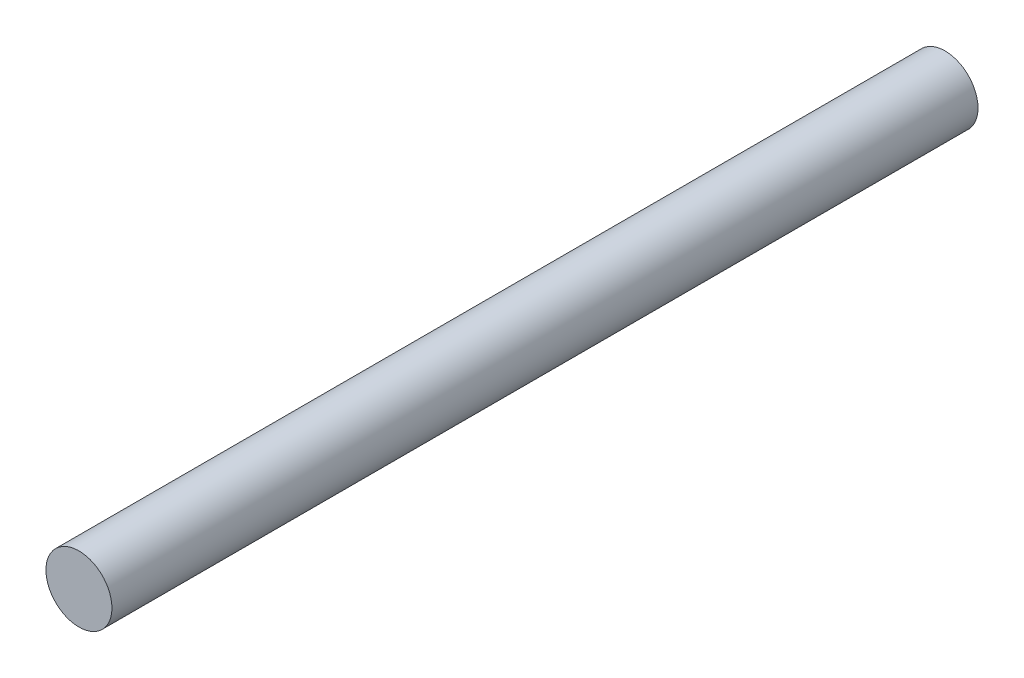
ISO-10303-21;
HEADER;
FILE_DESCRIPTION(('STEP AP214'),'2;1');
FILE_NAME('part.step','',(''),(''),'','','');
FILE_SCHEMA(('AUTOMOTIVE_DESIGN { 1 0 10303 214 1 1 1 1 }'));
ENDSEC;
DATA;
#1=APPLICATION_CONTEXT('core data for automotive mechanical design processes');
#2=APPLICATION_PROTOCOL_DEFINITION('international standard','automotive_design',2000,#1);
#3=PRODUCT_CONTEXT('',#1,'mechanical');
#4=PRODUCT('Part','Part','',(#3));
#5=PRODUCT_RELATED_PRODUCT_CATEGORY('part','',(#4));
#6=PRODUCT_DEFINITION_FORMATION('','',#4);
#7=PRODUCT_DEFINITION_CONTEXT('part definition',#1,'design');
#8=PRODUCT_DEFINITION('design','',#6,#7);
#9=PRODUCT_DEFINITION_SHAPE('','',#8);
#10=(LENGTH_UNIT() NAMED_UNIT(*) SI_UNIT(.MILLI.,.METRE.));
#11=(NAMED_UNIT(*) PLANE_ANGLE_UNIT() SI_UNIT($,.RADIAN.));
#12=(NAMED_UNIT(*) SI_UNIT($,.STERADIAN.) SOLID_ANGLE_UNIT());
#13=UNCERTAINTY_MEASURE_WITH_UNIT(LENGTH_MEASURE(1.E-05),#10,'distance_accuracy_value','');
#14=(GEOMETRIC_REPRESENTATION_CONTEXT(3) GLOBAL_UNCERTAINTY_ASSIGNED_CONTEXT((#13)) GLOBAL_UNIT_ASSIGNED_CONTEXT((#10,
#11,#12)) REPRESENTATION_CONTEXT('',''));
#15=CARTESIAN_POINT('',(0.,0.,0.));
#16=DIRECTION('',(0.,0.,1.));
#17=DIRECTION('',(1.,0.,0.));
#18=AXIS2_PLACEMENT_3D('',#15,#16,#17);
#19=CARTESIAN_POINT('',(0.,0.,150.));
#20=DIRECTION('',(0.,0.,-1.));
#21=DIRECTION('',(-1.,0.,0.));
#22=AXIS2_PLACEMENT_3D('',#19,#20,#21);
#23=CYLINDRICAL_SURFACE('',#22,5.715);
#24=CARTESIAN_POINT('',(0.,0.,150.));
#25=DIRECTION('',(0.,0.,1.));
#26=DIRECTION('',(1.,0.,0.));
#27=AXIS2_PLACEMENT_3D('',#24,#25,#26);
#28=CIRCLE('',#27,5.715);
#29=CARTESIAN_POINT('',(5.715,0.,150.));
#30=VERTEX_POINT('',#29);
#31=EDGE_CURVE('E10',#30,#30,#28,.T.);
#32=ORIENTED_EDGE('',*,*,#31,.F.);
#33=EDGE_LOOP('',(#32));
#34=FACE_BOUND('',#33,.T.);
#35=CARTESIAN_POINT('',(0.,0.,0.));
#36=DIRECTION('',(0.,0.,1.));
#37=DIRECTION('',(1.,0.,0.));
#38=AXIS2_PLACEMENT_3D('',#35,#36,#37);
#39=CIRCLE('',#38,5.715);
#40=CARTESIAN_POINT('',(5.715,0.,0.));
#41=VERTEX_POINT('',#40);
#42=EDGE_CURVE('E34',#41,#41,#39,.T.);
#43=ORIENTED_EDGE('',*,*,#42,.T.);
#44=EDGE_LOOP('',(#43));
#45=FACE_BOUND('',#44,.T.);
#46=ADVANCED_FACE('F31',(#34,#45),#23,.T.);
#47=CARTESIAN_POINT('',(0.,0.,150.));
#48=DIRECTION('',(0.,0.,1.));
#49=DIRECTION('',(1.,0.,0.));
#50=AXIS2_PLACEMENT_3D('',#47,#48,#49);
#51=PLANE('',#50);
#52=ORIENTED_EDGE('',*,*,#31,.T.);
#53=EDGE_LOOP('',(#52));
#54=FACE_BOUND('',#53,.T.);
#55=ADVANCED_FACE('F46',(#54),#51,.T.);
#56=CARTESIAN_POINT('',(0.,0.,0.));
#57=DIRECTION('',(0.,0.,1.));
#58=DIRECTION('',(1.,0.,0.));
#59=AXIS2_PLACEMENT_3D('',#56,#57,#58);
#60=PLANE('',#59);
#61=ORIENTED_EDGE('',*,*,#42,.F.);
#62=EDGE_LOOP('',(#61));
#63=FACE_BOUND('',#62,.T.);
#64=ADVANCED_FACE('F44',(#63),#60,.F.);
#65=CLOSED_SHELL('',(#46,#55,#64));
#66=MANIFOLD_SOLID_BREP('B2',#65);
#67=ADVANCED_BREP_SHAPE_REPRESENTATION('',(#18,#66),#14);
#68=SHAPE_DEFINITION_REPRESENTATION(#9,#67);
ENDSEC;
END-ISO-10303-21;
